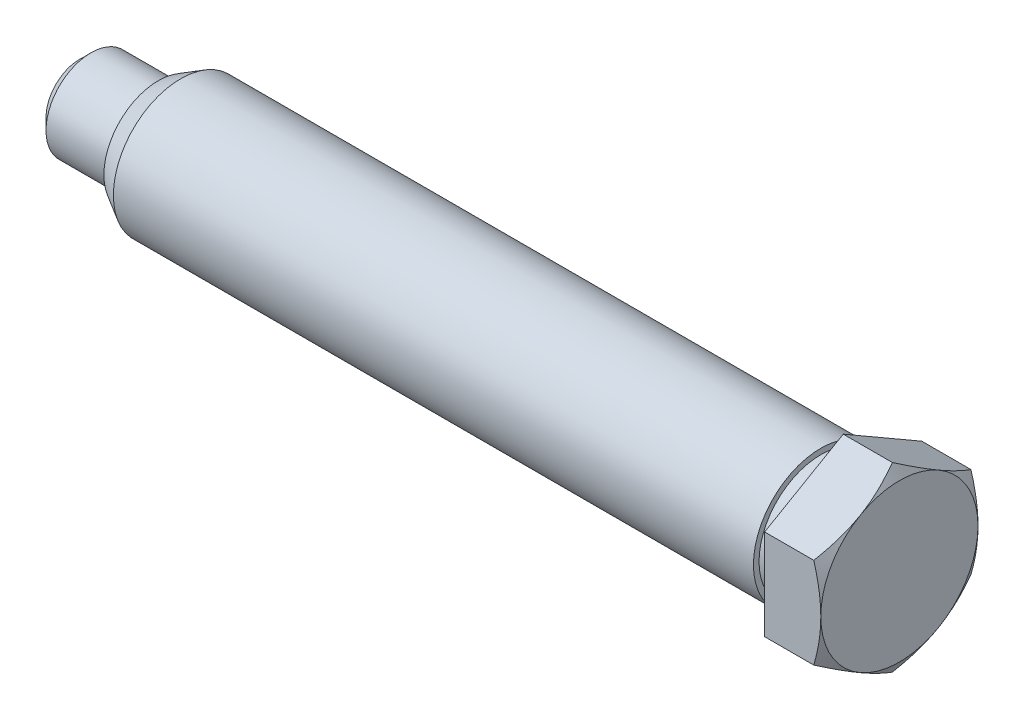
from build123d import *

# Parameters (mm, degrees)
CHANFREIN1_SIZE              = 1
ESQUISSE2_OUTSIDE_W          = 35.462
ESQUISSE2_OUTSIDE_H          = 35.462
ESQUISSE2_OUTSIDE_W_2        = 14
ESQUISSE2_OUTSIDE_H_2        = 20
ENL_V_MAT_EXTRU_1_DEPTH      = 75.10128204
R_P_TITION_CIRCULAIRE2_COUNT = 3
R_P_TITION_CIRCULAIRE2_ANGLE = 120


with BuildPart() as part:
    # Esquisse1 → Base-R_volution (revolve)
    with BuildSketch(Plane.XY, mode=Mode.PRIVATE) as base_r_volution_sk:
        Polygon((-80, 0), (-80, 4), (-73, 4), (-73, 4.845299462), (-71, 6), (-14, 6), (-14, 5.5), (-12, 5.5), (-12, 9), (-8.154700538, 9), (-7, 7), (-7, 0), align=None)
    revolve(base_r_volution_sk.sketch.rotate(Axis((-100, 0, 0), (1, 0, 0)), 90), axis=Axis((-100, 0, 0), (1, 0, 0)))

    # Chanfrein1
    chanfrein1_edges = [part.edges().sort_by_distance(p)[0] for p in [
        (-80, 0, -4),
    ]]
    chamfer(chanfrein1_edges, length=CHANFREIN1_SIZE)

    # Esquisse2 outside → Enl_v. mat.-Extru.1 (cut, through all)
    with BuildSketch(Plane(origin=(-7, 0, 0), x_dir=(0, 0, -1), z_dir=(1, 0, 0))):
        Rectangle(ESQUISSE2_OUTSIDE_W, ESQUISSE2_OUTSIDE_H)
        Rectangle(ESQUISSE2_OUTSIDE_W_2, ESQUISSE2_OUTSIDE_H_2, mode=Mode.SUBTRACT)
    enl_v_mat_extru_1 = extrude(amount=-ENL_V_MAT_EXTRU_1_DEPTH, mode=Mode.SUBTRACT)

    # R_p_tition circulaire2: Enl_v. mat.-Extru.1 ×3 about axis
    r_p_tition_circulaire2_axis = Axis((0, 0, 0), (1, 0, 0))
    for i in range(1, R_P_TITION_CIRCULAIRE2_COUNT):
        add(enl_v_mat_extru_1.rotate(r_p_tition_circulaire2_axis, i * R_P_TITION_CIRCULAIRE2_ANGLE / (R_P_TITION_CIRCULAIRE2_COUNT - 1)), mode=Mode.SUBTRACT)


solid = part.part
